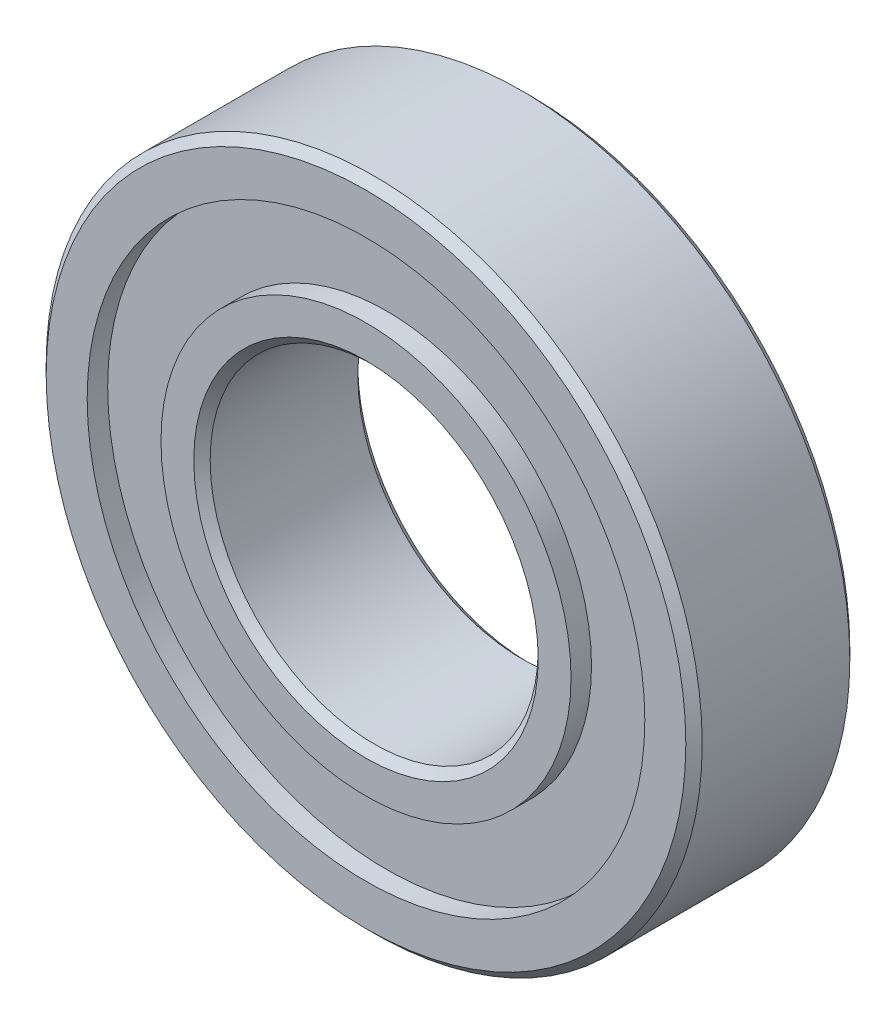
ISO-10303-21;
HEADER;
FILE_DESCRIPTION(('STEP AP214'),'2;1');
FILE_NAME('part.step','',(''),(''),'','','');
FILE_SCHEMA(('AUTOMOTIVE_DESIGN { 1 0 10303 214 1 1 1 1 }'));
ENDSEC;
DATA;
#1=APPLICATION_CONTEXT('core data for automotive mechanical design processes');
#2=APPLICATION_PROTOCOL_DEFINITION('international standard','automotive_design',2000,#1);
#3=PRODUCT_CONTEXT('',#1,'mechanical');
#4=PRODUCT('Part','Part','',(#3));
#5=PRODUCT_RELATED_PRODUCT_CATEGORY('part','',(#4));
#6=PRODUCT_DEFINITION_FORMATION('','',#4);
#7=PRODUCT_DEFINITION_CONTEXT('part definition',#1,'design');
#8=PRODUCT_DEFINITION('design','',#6,#7);
#9=PRODUCT_DEFINITION_SHAPE('','',#8);
#10=(LENGTH_UNIT() NAMED_UNIT(*) SI_UNIT(.MILLI.,.METRE.));
#11=(NAMED_UNIT(*) PLANE_ANGLE_UNIT() SI_UNIT($,.RADIAN.));
#12=(NAMED_UNIT(*) SI_UNIT($,.STERADIAN.) SOLID_ANGLE_UNIT());
#13=UNCERTAINTY_MEASURE_WITH_UNIT(LENGTH_MEASURE(1.E-05),#10,'distance_accuracy_value','');
#14=(GEOMETRIC_REPRESENTATION_CONTEXT(3) GLOBAL_UNCERTAINTY_ASSIGNED_CONTEXT((#13)) GLOBAL_UNIT_ASSIGNED_CONTEXT((#10,
#11,#12)) REPRESENTATION_CONTEXT('',''));
#15=CARTESIAN_POINT('',(0.,0.,0.));
#16=DIRECTION('',(0.,0.,1.));
#17=DIRECTION('',(1.,0.,0.));
#18=AXIS2_PLACEMENT_3D('',#15,#16,#17);
#19=CARTESIAN_POINT('',(0.,2.,-1.));
#20=DIRECTION('',(0.,0.,1.));
#21=DIRECTION('',(1.,0.,0.));
#22=AXIS2_PLACEMENT_3D('',#19,#20,#21);
#23=PLANE('',#22);
#24=CARTESIAN_POINT('',(0.,0.,-1.));
#25=DIRECTION('',(0.,0.,1.));
#26=DIRECTION('',(1.,0.,0.));
#27=AXIS2_PLACEMENT_3D('',#24,#25,#26);
#28=CIRCLE('',#27,2.1);
#29=CARTESIAN_POINT('',(2.1,0.,-1.));
#30=VERTEX_POINT('',#29);
#31=EDGE_CURVE('E60',#30,#30,#28,.T.);
#32=ORIENTED_EDGE('',*,*,#31,.T.);
#33=EDGE_LOOP('',(#32));
#34=FACE_BOUND('',#33,.T.);
#35=CARTESIAN_POINT('',(0.,0.,-1.));
#36=DIRECTION('',(0.,0.,1.));
#37=DIRECTION('',(1.,0.,0.));
#38=AXIS2_PLACEMENT_3D('',#35,#36,#37);
#39=CIRCLE('',#38,2.5);
#40=CARTESIAN_POINT('',(2.5,0.,-1.));
#41=VERTEX_POINT('',#40);
#42=EDGE_CURVE('E63',#41,#41,#39,.T.);
#43=ORIENTED_EDGE('',*,*,#42,.F.);
#44=EDGE_LOOP('',(#43));
#45=FACE_BOUND('',#44,.T.);
#46=ADVANCED_FACE('F31',(#34,#45),#23,.F.);
#47=CARTESIAN_POINT('',(0.,0.,11.8458465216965));
#48=DIRECTION('',(0.,0.,1.));
#49=DIRECTION('',(1.,0.,0.));
#50=AXIS2_PLACEMENT_3D('',#47,#48,#49);
#51=CYLINDRICAL_SURFACE('',#50,2.5);
#52=CARTESIAN_POINT('',(0.,0.,-0.750000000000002));
#53=DIRECTION('',(0.,0.,1.));
#54=DIRECTION('',(1.,0.,0.));
#55=AXIS2_PLACEMENT_3D('',#52,#53,#54);
#56=CIRCLE('',#55,2.5);
#57=CARTESIAN_POINT('',(2.5,0.,-0.750000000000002));
#58=VERTEX_POINT('',#57);
#59=EDGE_CURVE('E66',#58,#58,#56,.T.);
#60=ORIENTED_EDGE('',*,*,#59,.F.);
#61=EDGE_LOOP('',(#60));
#62=FACE_BOUND('',#61,.T.);
#63=ORIENTED_EDGE('',*,*,#42,.T.);
#64=EDGE_LOOP('',(#63));
#65=FACE_BOUND('',#64,.T.);
#66=ADVANCED_FACE('F119',(#62,#65),#51,.T.);
#67=CARTESIAN_POINT('',(0.,2.5,-0.750000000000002));
#68=DIRECTION('',(0.,0.,1.));
#69=DIRECTION('',(1.,0.,0.));
#70=AXIS2_PLACEMENT_3D('',#67,#68,#69);
#71=PLANE('',#70);
#72=CARTESIAN_POINT('',(0.,0.,-0.750000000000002));
#73=DIRECTION('',(0.,0.,1.));
#74=DIRECTION('',(1.,0.,0.));
#75=AXIS2_PLACEMENT_3D('',#72,#73,#74);
#76=CIRCLE('',#75,3.4);
#77=CARTESIAN_POINT('',(3.4,0.,-0.750000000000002));
#78=VERTEX_POINT('',#77);
#79=EDGE_CURVE('E69',#78,#78,#76,.T.);
#80=ORIENTED_EDGE('',*,*,#79,.F.);
#81=EDGE_LOOP('',(#80));
#82=FACE_BOUND('',#81,.T.);
#83=ORIENTED_EDGE('',*,*,#59,.T.);
#84=EDGE_LOOP('',(#83));
#85=FACE_BOUND('',#84,.T.);
#86=ADVANCED_FACE('F125',(#82,#85),#71,.F.);
#87=CARTESIAN_POINT('',(0.,0.,11.8458465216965));
#88=DIRECTION('',(0.,0.,1.));
#89=DIRECTION('',(1.,0.,0.));
#90=AXIS2_PLACEMENT_3D('',#87,#88,#89);
#91=CYLINDRICAL_SURFACE('',#90,3.4);
#92=CARTESIAN_POINT('',(0.,0.,-1.));
#93=DIRECTION('',(0.,0.,1.));
#94=DIRECTION('',(1.,0.,0.));
#95=AXIS2_PLACEMENT_3D('',#92,#93,#94);
#96=CIRCLE('',#95,3.4);
#97=CARTESIAN_POINT('',(3.4,0.,-1.));
#98=VERTEX_POINT('',#97);
#99=EDGE_CURVE('E72',#98,#98,#96,.T.);
#100=ORIENTED_EDGE('',*,*,#99,.F.);
#101=EDGE_LOOP('',(#100));
#102=FACE_BOUND('',#101,.T.);
#103=ORIENTED_EDGE('',*,*,#79,.T.);
#104=EDGE_LOOP('',(#103));
#105=FACE_BOUND('',#104,.T.);
#106=ADVANCED_FACE('F207',(#102,#105),#91,.F.);
#107=CARTESIAN_POINT('',(0.,3.4,-1.));
#108=DIRECTION('',(0.,0.,1.));
#109=DIRECTION('',(1.,0.,0.));
#110=AXIS2_PLACEMENT_3D('',#107,#108,#109);
#111=PLANE('',#110);
#112=CARTESIAN_POINT('',(0.,0.,-1.));
#113=DIRECTION('',(0.,0.,1.));
#114=DIRECTION('',(1.,0.,0.));
#115=AXIS2_PLACEMENT_3D('',#112,#113,#114);
#116=CIRCLE('',#115,3.9);
#117=CARTESIAN_POINT('',(3.9,0.,-1.));
#118=VERTEX_POINT('',#117);
#119=EDGE_CURVE('E38',#118,#118,#116,.F.);
#120=ORIENTED_EDGE('',*,*,#119,.T.);
#121=EDGE_LOOP('',(#120));
#122=FACE_BOUND('',#121,.T.);
#123=ORIENTED_EDGE('',*,*,#99,.T.);
#124=EDGE_LOOP('',(#123));
#125=FACE_BOUND('',#124,.T.);
#126=ADVANCED_FACE('F115',(#122,#125),#111,.F.);
#127=CARTESIAN_POINT('',(0.,0.,11.8458465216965));
#128=DIRECTION('',(0.,0.,1.));
#129=DIRECTION('',(1.,0.,0.));
#130=AXIS2_PLACEMENT_3D('',#127,#128,#129);
#131=CYLINDRICAL_SURFACE('',#130,4.);
#132=CARTESIAN_POINT('',(0.,0.,-0.900000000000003));
#133=DIRECTION('',(0.,0.,1.));
#134=DIRECTION('',(1.,0.,0.));
#135=AXIS2_PLACEMENT_3D('',#132,#133,#134);
#136=CIRCLE('',#135,4.);
#137=CARTESIAN_POINT('',(4.,0.,-0.900000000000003));
#138=VERTEX_POINT('',#137);
#139=EDGE_CURVE('E42',#138,#138,#136,.T.);
#140=ORIENTED_EDGE('',*,*,#139,.T.);
#141=EDGE_LOOP('',(#140));
#142=FACE_BOUND('',#141,.T.);
#143=CARTESIAN_POINT('',(0.,0.,0.900000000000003));
#144=DIRECTION('',(0.,0.,-1.));
#145=DIRECTION('',(-1.,0.,0.));
#146=AXIS2_PLACEMENT_3D('',#143,#144,#145);
#147=CIRCLE('',#146,4.);
#148=CARTESIAN_POINT('',(-4.,0.,0.900000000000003));
#149=VERTEX_POINT('',#148);
#150=EDGE_CURVE('E46',#149,#149,#147,.T.);
#151=ORIENTED_EDGE('',*,*,#150,.T.);
#152=EDGE_LOOP('',(#151));
#153=FACE_BOUND('',#152,.T.);
#154=ADVANCED_FACE('F110',(#142,#153),#131,.T.);
#155=CARTESIAN_POINT('',(0.,3.4,1.));
#156=DIRECTION('',(0.,0.,-1.));
#157=DIRECTION('',(-1.,0.,0.));
#158=AXIS2_PLACEMENT_3D('',#155,#156,#157);
#159=PLANE('',#158);
#160=CARTESIAN_POINT('',(0.,0.,1.));
#161=DIRECTION('',(0.,0.,-1.));
#162=DIRECTION('',(-1.,0.,0.));
#163=AXIS2_PLACEMENT_3D('',#160,#161,#162);
#164=CIRCLE('',#163,3.9);
#165=CARTESIAN_POINT('',(-3.9,0.,1.));
#166=VERTEX_POINT('',#165);
#167=EDGE_CURVE('E10',#166,#166,#164,.F.);
#168=ORIENTED_EDGE('',*,*,#167,.T.);
#169=EDGE_LOOP('',(#168));
#170=FACE_BOUND('',#169,.T.);
#171=CARTESIAN_POINT('',(0.,0.,1.));
#172=DIRECTION('',(0.,0.,1.));
#173=DIRECTION('',(1.,0.,0.));
#174=AXIS2_PLACEMENT_3D('',#171,#172,#173);
#175=CIRCLE('',#174,3.4);
#176=CARTESIAN_POINT('',(3.4,0.,1.));
#177=VERTEX_POINT('',#176);
#178=EDGE_CURVE('E75',#177,#177,#175,.T.);
#179=ORIENTED_EDGE('',*,*,#178,.F.);
#180=EDGE_LOOP('',(#179));
#181=FACE_BOUND('',#180,.T.);
#182=ADVANCED_FACE('F105',(#170,#181),#159,.F.);
#183=CARTESIAN_POINT('',(0.,0.,11.8458465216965));
#184=DIRECTION('',(0.,0.,1.));
#185=DIRECTION('',(1.,0.,0.));
#186=AXIS2_PLACEMENT_3D('',#183,#184,#185);
#187=CYLINDRICAL_SURFACE('',#186,3.4);
#188=CARTESIAN_POINT('',(0.,0.,0.750000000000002));
#189=DIRECTION('',(0.,0.,1.));
#190=DIRECTION('',(1.,0.,0.));
#191=AXIS2_PLACEMENT_3D('',#188,#189,#190);
#192=CIRCLE('',#191,3.4);
#193=CARTESIAN_POINT('',(3.4,0.,0.750000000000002));
#194=VERTEX_POINT('',#193);
#195=EDGE_CURVE('E78',#194,#194,#192,.T.);
#196=ORIENTED_EDGE('',*,*,#195,.F.);
#197=EDGE_LOOP('',(#196));
#198=FACE_BOUND('',#197,.T.);
#199=ORIENTED_EDGE('',*,*,#178,.T.);
#200=EDGE_LOOP('',(#199));
#201=FACE_BOUND('',#200,.T.);
#202=ADVANCED_FACE('F99',(#198,#201),#187,.F.);
#203=CARTESIAN_POINT('',(0.,2.5,0.750000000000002));
#204=DIRECTION('',(0.,0.,-1.));
#205=DIRECTION('',(-1.,0.,0.));
#206=AXIS2_PLACEMENT_3D('',#203,#204,#205);
#207=PLANE('',#206);
#208=CARTESIAN_POINT('',(0.,0.,0.750000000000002));
#209=DIRECTION('',(0.,0.,1.));
#210=DIRECTION('',(1.,0.,0.));
#211=AXIS2_PLACEMENT_3D('',#208,#209,#210);
#212=CIRCLE('',#211,2.5);
#213=CARTESIAN_POINT('',(2.5,0.,0.750000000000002));
#214=VERTEX_POINT('',#213);
#215=EDGE_CURVE('E81',#214,#214,#212,.T.);
#216=ORIENTED_EDGE('',*,*,#215,.F.);
#217=EDGE_LOOP('',(#216));
#218=FACE_BOUND('',#217,.T.);
#219=ORIENTED_EDGE('',*,*,#195,.T.);
#220=EDGE_LOOP('',(#219));
#221=FACE_BOUND('',#220,.T.);
#222=ADVANCED_FACE('F93',(#218,#221),#207,.F.);
#223=CARTESIAN_POINT('',(0.,0.,11.8458465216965));
#224=DIRECTION('',(0.,0.,1.));
#225=DIRECTION('',(1.,0.,0.));
#226=AXIS2_PLACEMENT_3D('',#223,#224,#225);
#227=CYLINDRICAL_SURFACE('',#226,2.5);
#228=CARTESIAN_POINT('',(0.,0.,1.));
#229=DIRECTION('',(0.,0.,1.));
#230=DIRECTION('',(1.,0.,0.));
#231=AXIS2_PLACEMENT_3D('',#228,#229,#230);
#232=CIRCLE('',#231,2.5);
#233=CARTESIAN_POINT('',(2.5,0.,1.));
#234=VERTEX_POINT('',#233);
#235=EDGE_CURVE('E84',#234,#234,#232,.T.);
#236=ORIENTED_EDGE('',*,*,#235,.F.);
#237=EDGE_LOOP('',(#236));
#238=FACE_BOUND('',#237,.T.);
#239=ORIENTED_EDGE('',*,*,#215,.T.);
#240=EDGE_LOOP('',(#239));
#241=FACE_BOUND('',#240,.T.);
#242=ADVANCED_FACE('F90',(#238,#241),#227,.T.);
#243=CARTESIAN_POINT('',(0.,2.,1.));
#244=DIRECTION('',(0.,0.,-1.));
#245=DIRECTION('',(-1.,0.,0.));
#246=AXIS2_PLACEMENT_3D('',#243,#244,#245);
#247=PLANE('',#246);
#248=CARTESIAN_POINT('',(0.,0.,1.));
#249=DIRECTION('',(0.,0.,-1.));
#250=DIRECTION('',(-1.,0.,0.));
#251=AXIS2_PLACEMENT_3D('',#248,#249,#250);
#252=CIRCLE('',#251,2.1);
#253=CARTESIAN_POINT('',(-2.1,0.,1.));
#254=VERTEX_POINT('',#253);
#255=EDGE_CURVE('E51',#254,#254,#252,.T.);
#256=ORIENTED_EDGE('',*,*,#255,.T.);
#257=EDGE_LOOP('',(#256));
#258=FACE_BOUND('',#257,.T.);
#259=ORIENTED_EDGE('',*,*,#235,.T.);
#260=EDGE_LOOP('',(#259));
#261=FACE_BOUND('',#260,.T.);
#262=ADVANCED_FACE('F88',(#258,#261),#247,.F.);
#263=CARTESIAN_POINT('',(0.,0.,11.8458465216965));
#264=DIRECTION('',(0.,0.,1.));
#265=DIRECTION('',(1.,0.,0.));
#266=AXIS2_PLACEMENT_3D('',#263,#264,#265);
#267=CYLINDRICAL_SURFACE('',#266,2.);
#268=CARTESIAN_POINT('',(0.,0.,-0.900000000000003));
#269=DIRECTION('',(0.,0.,1.));
#270=DIRECTION('',(1.,0.,0.));
#271=AXIS2_PLACEMENT_3D('',#268,#269,#270);
#272=CIRCLE('',#271,2.);
#273=CARTESIAN_POINT('',(2.,0.,-0.900000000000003));
#274=VERTEX_POINT('',#273);
#275=EDGE_CURVE('E54',#274,#274,#272,.F.);
#276=ORIENTED_EDGE('',*,*,#275,.T.);
#277=EDGE_LOOP('',(#276));
#278=FACE_BOUND('',#277,.T.);
#279=CARTESIAN_POINT('',(0.,0.,0.900000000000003));
#280=DIRECTION('',(0.,0.,-1.));
#281=DIRECTION('',(-1.,0.,0.));
#282=AXIS2_PLACEMENT_3D('',#279,#280,#281);
#283=CIRCLE('',#282,2.);
#284=CARTESIAN_POINT('',(-2.,0.,0.900000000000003));
#285=VERTEX_POINT('',#284);
#286=EDGE_CURVE('E57',#285,#285,#283,.F.);
#287=ORIENTED_EDGE('',*,*,#286,.T.);
#288=EDGE_LOOP('',(#287));
#289=FACE_BOUND('',#288,.T.);
#290=ADVANCED_FACE('F135',(#278,#289),#267,.F.);
#291=CARTESIAN_POINT('',(0.,0.,-1.));
#292=DIRECTION('',(0.,0.,-1.));
#293=DIRECTION('',(-1.,0.,0.));
#294=AXIS2_PLACEMENT_3D('',#291,#292,#293);
#295=CONICAL_SURFACE('',#294,2.1,0.785398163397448);
#296=ORIENTED_EDGE('',*,*,#275,.F.);
#297=EDGE_LOOP('',(#296));
#298=FACE_BOUND('',#297,.T.);
#299=ORIENTED_EDGE('',*,*,#31,.F.);
#300=EDGE_LOOP('',(#299));
#301=FACE_BOUND('',#300,.T.);
#302=ADVANCED_FACE('F131',(#298,#301),#295,.F.);
#303=CARTESIAN_POINT('',(0.,0.,0.900000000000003));
#304=DIRECTION('',(0.,0.,1.));
#305=DIRECTION('',(1.,0.,0.));
#306=AXIS2_PLACEMENT_3D('',#303,#304,#305);
#307=CONICAL_SURFACE('',#306,2.,0.785398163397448);
#308=ORIENTED_EDGE('',*,*,#255,.F.);
#309=EDGE_LOOP('',(#308));
#310=FACE_BOUND('',#309,.T.);
#311=ORIENTED_EDGE('',*,*,#286,.F.);
#312=EDGE_LOOP('',(#311));
#313=FACE_BOUND('',#312,.T.);
#314=ADVANCED_FACE('F134',(#310,#313),#307,.F.);
#315=CARTESIAN_POINT('',(0.,0.,-0.900000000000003));
#316=DIRECTION('',(0.,0.,1.));
#317=DIRECTION('',(1.,0.,0.));
#318=AXIS2_PLACEMENT_3D('',#315,#316,#317);
#319=CONICAL_SURFACE('',#318,4.,0.785398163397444);
#320=ORIENTED_EDGE('',*,*,#119,.F.);
#321=EDGE_LOOP('',(#320));
#322=FACE_BOUND('',#321,.T.);
#323=ORIENTED_EDGE('',*,*,#139,.F.);
#324=EDGE_LOOP('',(#323));
#325=FACE_BOUND('',#324,.T.);
#326=ADVANCED_FACE('F138',(#322,#325),#319,.T.);
#327=CARTESIAN_POINT('',(0.,0.,1.));
#328=DIRECTION('',(0.,0.,-1.));
#329=DIRECTION('',(-1.,0.,0.));
#330=AXIS2_PLACEMENT_3D('',#327,#328,#329);
#331=CONICAL_SURFACE('',#330,3.9,0.785398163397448);
#332=ORIENTED_EDGE('',*,*,#150,.F.);
#333=EDGE_LOOP('',(#332));
#334=FACE_BOUND('',#333,.T.);
#335=ORIENTED_EDGE('',*,*,#167,.F.);
#336=EDGE_LOOP('',(#335));
#337=FACE_BOUND('',#336,.T.);
#338=ADVANCED_FACE('F33',(#334,#337),#331,.T.);
#339=CLOSED_SHELL('',(#46,#66,#86,#106,#126,#154,#182,#202,#222,#242,#262,#290,#302,#314,#326,#338));
#340=MANIFOLD_SOLID_BREP('B2',#339);
#341=ADVANCED_BREP_SHAPE_REPRESENTATION('',(#18,#340),#14);
#342=SHAPE_DEFINITION_REPRESENTATION(#9,#341);
ENDSEC;
END-ISO-10303-21;
